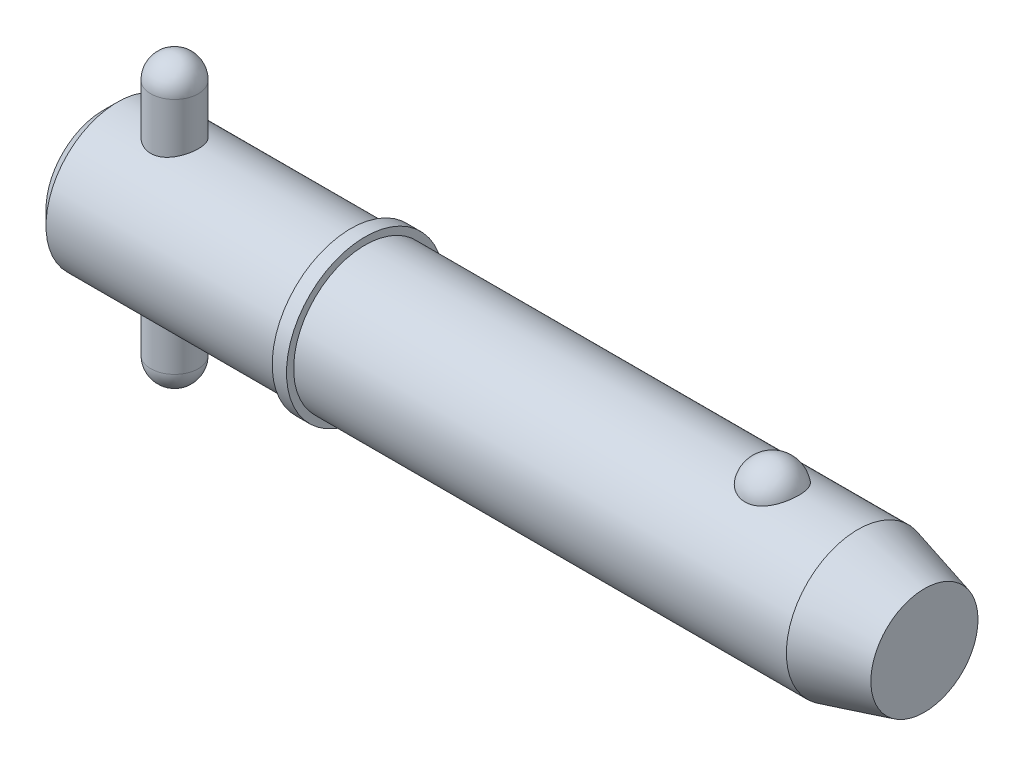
ISO-10303-21;
HEADER;
FILE_DESCRIPTION(('STEP AP214'),'2;1');
FILE_NAME('part.step','',(''),(''),'','','');
FILE_SCHEMA(('AUTOMOTIVE_DESIGN { 1 0 10303 214 1 1 1 1 }'));
ENDSEC;
DATA;
#1=APPLICATION_CONTEXT('core data for automotive mechanical design processes');
#2=APPLICATION_PROTOCOL_DEFINITION('international standard','automotive_design',2000,#1);
#3=PRODUCT_CONTEXT('',#1,'mechanical');
#4=PRODUCT('Part','Part','',(#3));
#5=PRODUCT_RELATED_PRODUCT_CATEGORY('part','',(#4));
#6=PRODUCT_DEFINITION_FORMATION('','',#4);
#7=PRODUCT_DEFINITION_CONTEXT('part definition',#1,'design');
#8=PRODUCT_DEFINITION('design','',#6,#7);
#9=PRODUCT_DEFINITION_SHAPE('','',#8);
#10=(LENGTH_UNIT() NAMED_UNIT(*) SI_UNIT(.MILLI.,.METRE.));
#11=(NAMED_UNIT(*) PLANE_ANGLE_UNIT() SI_UNIT($,.RADIAN.));
#12=(NAMED_UNIT(*) SI_UNIT($,.STERADIAN.) SOLID_ANGLE_UNIT());
#13=UNCERTAINTY_MEASURE_WITH_UNIT(LENGTH_MEASURE(1.E-05),#10,'distance_accuracy_value','');
#14=(GEOMETRIC_REPRESENTATION_CONTEXT(3) GLOBAL_UNCERTAINTY_ASSIGNED_CONTEXT((#13)) GLOBAL_UNIT_ASSIGNED_CONTEXT((#10,
#11,#12)) REPRESENTATION_CONTEXT('',''));
#15=CARTESIAN_POINT('',(0.,0.,0.));
#16=DIRECTION('',(0.,0.,1.));
#17=DIRECTION('',(1.,0.,0.));
#18=AXIS2_PLACEMENT_3D('',#15,#16,#17);
#19=CARTESIAN_POINT('',(9.525,19.05,0.));
#20=DIRECTION('',(0.,-1.,0.));
#21=DIRECTION('',(0.,0.,-1.));
#22=AXIS2_PLACEMENT_3D('',#19,#20,#21);
#23=CYLINDRICAL_SURFACE('',#22,3.175);
#24=CARTESIAN_POINT('',(9.525,-15.875,0.));
#25=DIRECTION('',(0.,-1.,0.));
#26=DIRECTION('',(0.,0.,-1.));
#27=AXIS2_PLACEMENT_3D('',#24,#25,#26);
#28=CIRCLE('',#27,3.175);
#29=CARTESIAN_POINT('',(9.525,-15.875,-3.175));
#30=VERTEX_POINT('',#29);
#31=EDGE_CURVE('P0_E10',#30,#30,#28,.F.);
#32=CARTESIAN_POINT('',(9.525,15.875,0.));
#33=DIRECTION('',(0.,-1.,0.));
#34=DIRECTION('',(0.,0.,-1.));
#35=AXIS2_PLACEMENT_3D('',#32,#33,#34);
#36=CIRCLE('',#35,3.175);
#37=CARTESIAN_POINT('',(9.525,15.875,-3.175));
#38=VERTEX_POINT('',#37);
#39=EDGE_CURVE('P0_E21',#38,#38,#36,.T.);
#40=CARTESIAN_POINT('',(9.525,-15.875,-3.175));
#41=CARTESIAN_POINT('',(9.525,-15.5442708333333,-3.175));
#42=CARTESIAN_POINT('',(9.525,-15.2135416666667,-3.175));
#43=CARTESIAN_POINT('',(9.525,-14.5520833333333,-3.175));
#44=CARTESIAN_POINT('',(9.525,-14.2213541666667,-3.175));
#45=CARTESIAN_POINT('',(9.525,-13.5598958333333,-3.175));
#46=CARTESIAN_POINT('',(9.525,-13.2291666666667,-3.175));
#47=CARTESIAN_POINT('',(9.525,-12.5677083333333,-3.175));
#48=CARTESIAN_POINT('',(9.525,-12.2369791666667,-3.175));
#49=CARTESIAN_POINT('',(9.525,-11.5755208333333,-3.175));
#50=CARTESIAN_POINT('',(9.525,-11.2447916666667,-3.175));
#51=CARTESIAN_POINT('',(9.525,-10.5833333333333,-3.175));
#52=CARTESIAN_POINT('',(9.525,-10.2526041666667,-3.175));
#53=CARTESIAN_POINT('',(9.525,-9.59114583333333,-3.175));
#54=CARTESIAN_POINT('',(9.525,-9.26041666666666,-3.175));
#55=CARTESIAN_POINT('',(9.525,-8.59895833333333,-3.175));
#56=CARTESIAN_POINT('',(9.525,-8.26822916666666,-3.175));
#57=CARTESIAN_POINT('',(9.525,-7.60677083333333,-3.175));
#58=CARTESIAN_POINT('',(9.525,-7.27604166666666,-3.175));
#59=CARTESIAN_POINT('',(9.525,-6.61458333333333,-3.175));
#60=CARTESIAN_POINT('',(9.525,-6.28385416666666,-3.175));
#61=CARTESIAN_POINT('',(9.525,-5.62239583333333,-3.175));
#62=CARTESIAN_POINT('',(9.525,-5.29166666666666,-3.175));
#63=CARTESIAN_POINT('',(9.525,-4.63020833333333,-3.175));
#64=CARTESIAN_POINT('',(9.525,-4.29947916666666,-3.175));
#65=CARTESIAN_POINT('',(9.525,-3.63802083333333,-3.175));
#66=CARTESIAN_POINT('',(9.525,-3.30729166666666,-3.175));
#67=CARTESIAN_POINT('',(9.525,-2.64583333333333,-3.175));
#68=CARTESIAN_POINT('',(9.525,-2.31510416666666,-3.175));
#69=CARTESIAN_POINT('',(9.525,-1.65364583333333,-3.175));
#70=CARTESIAN_POINT('',(9.525,-1.32291666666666,-3.175));
#71=CARTESIAN_POINT('',(9.525,-0.661458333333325,-3.175));
#72=CARTESIAN_POINT('',(9.525,-0.330729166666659,-3.175));
#73=CARTESIAN_POINT('',(9.525,0.330729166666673,-3.175));
#74=CARTESIAN_POINT('',(9.525,0.661458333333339,-3.175));
#75=CARTESIAN_POINT('',(9.525,1.32291666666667,-3.175));
#76=CARTESIAN_POINT('',(9.525,1.65364583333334,-3.175));
#77=CARTESIAN_POINT('',(9.525,2.31510416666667,-3.175));
#78=CARTESIAN_POINT('',(9.525,2.64583333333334,-3.175));
#79=CARTESIAN_POINT('',(9.525,3.30729166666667,-3.175));
#80=CARTESIAN_POINT('',(9.525,3.63802083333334,-3.175));
#81=CARTESIAN_POINT('',(9.525,4.29947916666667,-3.175));
#82=CARTESIAN_POINT('',(9.525,4.63020833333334,-3.175));
#83=CARTESIAN_POINT('',(9.525,5.29166666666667,-3.175));
#84=CARTESIAN_POINT('',(9.525,5.62239583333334,-3.175));
#85=CARTESIAN_POINT('',(9.525,6.28385416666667,-3.175));
#86=CARTESIAN_POINT('',(9.525,6.61458333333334,-3.175));
#87=CARTESIAN_POINT('',(9.525,7.27604166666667,-3.175));
#88=CARTESIAN_POINT('',(9.525,7.60677083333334,-3.175));
#89=CARTESIAN_POINT('',(9.525,8.26822916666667,-3.175));
#90=CARTESIAN_POINT('',(9.525,8.59895833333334,-3.175));
#91=CARTESIAN_POINT('',(9.525,9.26041666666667,-3.175));
#92=CARTESIAN_POINT('',(9.525,9.59114583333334,-3.175));
#93=CARTESIAN_POINT('',(9.525,10.2526041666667,-3.175));
#94=CARTESIAN_POINT('',(9.525,10.5833333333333,-3.175));
#95=CARTESIAN_POINT('',(9.525,11.2447916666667,-3.175));
#96=CARTESIAN_POINT('',(9.525,11.5755208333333,-3.175));
#97=CARTESIAN_POINT('',(9.525,12.2369791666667,-3.175));
#98=CARTESIAN_POINT('',(9.525,12.5677083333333,-3.175));
#99=CARTESIAN_POINT('',(9.525,13.2291666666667,-3.175));
#100=CARTESIAN_POINT('',(9.525,13.5598958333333,-3.175));
#101=CARTESIAN_POINT('',(9.525,14.2213541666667,-3.175));
#102=CARTESIAN_POINT('',(9.525,14.5520833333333,-3.175));
#103=CARTESIAN_POINT('',(9.525,15.2135416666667,-3.175));
#104=CARTESIAN_POINT('',(9.525,15.5442708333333,-3.175));
#105=CARTESIAN_POINT('',(9.525,15.875,-3.175));
#106=B_SPLINE_CURVE_WITH_KNOTS('',3,(#40,#41,#42,#43,#44,#45,#46,#47,#48,#49,#50,#51,#52,#53,
#54,#55,#56,#57,#58,#59,#60,#61,#62,#63,#64,#65,#66,#67,#68,#69,#70,#71,#72,#73,#74,#75,#76,#77,
#78,#79,#80,#81,#82,#83,#84,#85,#86,#87,#88,#89,#90,#91,#92,#93,#94,#95,#96,#97,#98,#99,#100,
#101,#102,#103,#104,#105),.UNSPECIFIED.,.F.,.F.,(4,2,2,2,2,2,2,2,2,2,2,2,2,2,2,2,2,2,2,2,2,2,2,
2,2,2,2,2,2,2,2,2,4),(0.,0.992187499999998,1.984375,2.9765625,3.96875,4.96093749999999,5.953125,
6.9453125,7.9375,8.92968749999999,9.921875,10.9140625,11.90625,12.8984375,13.890625,14.8828125,
15.875,16.8671875,17.859375,18.8515625,19.84375,20.8359375,21.828125,22.8203125,23.8125,
24.8046875,25.796875,26.7890625,27.78125,28.7734375,29.765625,30.7578125,31.75),.UNSPECIFIED.);
#107=EDGE_CURVE('P0_BSEAM14',#30,#38,#106,.T.);
#108=ORIENTED_EDGE('',*,*,#31,.T.);
#109=ORIENTED_EDGE('',*,*,#39,.T.);
#110=ORIENTED_EDGE('',*,*,#107,.T.);
#111=ORIENTED_EDGE('',*,*,#107,.F.);
#112=EDGE_LOOP('',(#108,#110,#109,#111));
#113=FACE_BOUND('',#112,.T.);
#114=ADVANCED_FACE('P0_F14',(#113),#23,.T.);
#115=CARTESIAN_POINT('',(9.525,-15.875,0.));
#116=DIRECTION('',(0.,0.,1.));
#117=DIRECTION('',(1.,0.,0.));
#118=AXIS2_PLACEMENT_3D('',#115,#116,#117);
#119=SPHERICAL_SURFACE('',#118,3.175);
#120=CARTESIAN_POINT('',(9.525,-15.875,0.));
#121=DIRECTION('',(0.,-1.,0.));
#122=DIRECTION('',(0.,0.,-1.));
#123=AXIS2_PLACEMENT_3D('',#120,#121,#122);
#124=SPHERICAL_SURFACE('',#123,3.175);
#125=ORIENTED_EDGE('',*,*,#31,.F.);
#126=EDGE_LOOP('',(#125));
#127=FACE_BOUND('',#126,.T.);
#128=ADVANCED_FACE('P0_F29',(#127),#124,.T.);
#129=CARTESIAN_POINT('',(9.525,15.875,0.));
#130=DIRECTION('',(0.,0.,1.));
#131=DIRECTION('',(1.,0.,0.));
#132=AXIS2_PLACEMENT_3D('',#129,#130,#131);
#133=SPHERICAL_SURFACE('',#132,3.175);
#134=CARTESIAN_POINT('',(9.525,15.875,0.));
#135=DIRECTION('',(0.,-1.,0.));
#136=DIRECTION('',(0.,0.,-1.));
#137=AXIS2_PLACEMENT_3D('',#134,#135,#136);
#138=SPHERICAL_SURFACE('',#137,3.175);
#139=ORIENTED_EDGE('',*,*,#39,.F.);
#140=EDGE_LOOP('',(#139));
#141=FACE_BOUND('',#140,.T.);
#142=ADVANCED_FACE('P0_F16',(#141),#138,.T.);
#143=CLOSED_SHELL('',(#114,#128,#142));
#144=MANIFOLD_SOLID_BREP('P0_B1',#143);
#145=CARTESIAN_POINT('',(0.,0.,0.));
#146=DIRECTION('',(1.,0.,0.));
#147=DIRECTION('',(0.,0.,-1.));
#148=AXIS2_PLACEMENT_3D('',#145,#146,#147);
#149=CYLINDRICAL_SURFACE('',#148,9.525);
#150=CARTESIAN_POINT('',(100.643054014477,0.,0.));
#151=DIRECTION('',(1.,0.,0.));
#152=DIRECTION('',(0.,0.,-1.));
#153=AXIS2_PLACEMENT_3D('',#150,#151,#152);
#154=CIRCLE('',#153,9.525);
#155=CARTESIAN_POINT('',(100.643054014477,0.,-9.525));
#156=VERTEX_POINT('',#155);
#157=EDGE_CURVE('P1_E81',#156,#156,#154,.T.);
#158=ORIENTED_EDGE('',*,*,#157,.F.);
#159=EDGE_LOOP('',(#158));
#160=FACE_BOUND('',#159,.T.);
#161=CARTESIAN_POINT('',(34.93,0.,0.));
#162=DIRECTION('',(1.,0.,0.));
#163=DIRECTION('',(0.,0.,-1.));
#164=AXIS2_PLACEMENT_3D('',#161,#162,#163);
#165=CIRCLE('',#164,9.525);
#166=CARTESIAN_POINT('',(34.93,0.,-9.525));
#167=VERTEX_POINT('',#166);
#168=EDGE_CURVE('P1_E85',#167,#167,#165,.T.);
#169=ORIENTED_EDGE('',*,*,#168,.T.);
#170=EDGE_LOOP('',(#169));
#171=FACE_BOUND('',#170,.T.);
#172=CARTESIAN_POINT('',(89.2457573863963,8.80405803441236,3.63513233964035));
#173=CARTESIAN_POINT('',(89.1516766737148,8.80405953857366,3.63513053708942));
#174=CARTESIAN_POINT('',(89.0575618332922,8.80561325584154,3.6313746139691));
#175=CARTESIAN_POINT('',(88.8700126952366,8.81177748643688,3.61638665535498));
#176=CARTESIAN_POINT('',(88.7765788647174,8.81638992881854,3.60514990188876));
#177=CARTESIAN_POINT('',(88.4979452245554,8.8346711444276,3.56024627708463));
#178=CARTESIAN_POINT('',(88.3146916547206,8.85278327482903,3.51538626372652));
#179=CARTESIAN_POINT('',(87.9595099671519,8.89871214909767,3.39742145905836));
#180=CARTESIAN_POINT('',(87.7875533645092,8.9265032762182,3.32439116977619));
#181=CARTESIAN_POINT('',(87.458707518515,8.98874819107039,3.15220244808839));
#182=CARTESIAN_POINT('',(87.3018114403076,9.02319893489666,3.05305594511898));
#183=CARTESIAN_POINT('',(87.0022147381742,9.09629186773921,2.82797815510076));
#184=CARTESIAN_POINT('',(86.8600600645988,9.13502685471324,2.7013513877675));
#185=CARTESIAN_POINT('',(86.5982999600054,9.2118657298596,2.4264193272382));
#186=CARTESIAN_POINT('',(86.4787015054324,9.2499694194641,2.27810735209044));
#187=CARTESIAN_POINT('',(86.259645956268,9.3234108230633,1.95652290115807));
#188=CARTESIAN_POINT('',(86.1613174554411,9.35855090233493,1.78243511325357));
#189=CARTESIAN_POINT('',(85.9938190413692,9.42045142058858,1.41937246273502));
#190=CARTESIAN_POINT('',(85.9246511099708,9.44721128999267,1.23039658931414));
#191=CARTESIAN_POINT('',(85.8161994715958,9.48990641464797,0.840370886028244));
#192=CARTESIAN_POINT('',(85.7772880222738,9.50570658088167,0.639202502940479));
#193=CARTESIAN_POINT('',(85.7315550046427,9.52433146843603,0.232664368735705));
#194=CARTESIAN_POINT('',(85.7247324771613,9.52715657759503,0.0272947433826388));
#195=CARTESIAN_POINT('',(85.743255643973,9.51956918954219,-0.380478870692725));
#196=CARTESIAN_POINT('',(85.7684052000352,9.50923740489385,-0.58289331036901));
#197=CARTESIAN_POINT('',(85.8500253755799,9.47651897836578,-0.980293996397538));
#198=CARTESIAN_POINT('',(85.9064966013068,9.45413210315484,-1.17528009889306));
#199=CARTESIAN_POINT('',(86.0497192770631,9.39954044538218,-1.55263697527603));
#200=CARTESIAN_POINT('',(86.1365124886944,9.36732213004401,-1.73498993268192));
#201=CARTESIAN_POINT('',(86.3386103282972,9.29640700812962,-2.08177763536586));
#202=CARTESIAN_POINT('',(86.4539172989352,9.25770966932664,-2.24621090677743));
#203=CARTESIAN_POINT('',(86.711264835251,9.17775604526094,-2.5533833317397));
#204=CARTESIAN_POINT('',(86.8534344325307,9.136488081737,-2.696011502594));
#205=CARTESIAN_POINT('',(87.16089985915,9.05620497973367,-2.95451229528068));
#206=CARTESIAN_POINT('',(87.3261937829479,9.01718965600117,-3.07038711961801));
#207=CARTESIAN_POINT('',(87.672052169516,8.9468001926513,-3.26976836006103));
#208=CARTESIAN_POINT('',(87.8522278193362,8.91528408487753,-3.35389750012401));
#209=CARTESIAN_POINT('',(88.2256514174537,8.86272514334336,-3.49043503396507));
#210=CARTESIAN_POINT('',(88.4188944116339,8.8416783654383,-3.54285537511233));
#211=CARTESIAN_POINT('',(88.8025036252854,8.81348056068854,-3.61241306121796));
#212=CARTESIAN_POINT('',(88.9925251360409,8.80568348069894,-3.63119339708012));
#213=CARTESIAN_POINT('',(89.3731906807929,8.80289410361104,-3.63795342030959));
#214=CARTESIAN_POINT('',(89.5638345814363,8.80789922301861,-3.62593932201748));
#215=CARTESIAN_POINT('',(89.9340076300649,8.8297491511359,-3.57238430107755));
#216=CARTESIAN_POINT('',(90.1136976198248,8.84621463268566,-3.53178890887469));
#217=CARTESIAN_POINT('',(90.463422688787,8.88875330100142,-3.42331083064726));
#218=CARTESIAN_POINT('',(90.6334569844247,8.91482726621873,-3.35542593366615));
#219=CARTESIAN_POINT('',(90.9632377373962,8.97448239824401,-3.19248225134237));
#220=CARTESIAN_POINT('',(91.1226801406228,9.00821446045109,-3.09686474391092));
#221=CARTESIAN_POINT('',(91.4235136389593,9.07935398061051,-2.88162736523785));
#222=CARTESIAN_POINT('',(91.5649005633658,9.11676228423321,-2.76200196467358));
#223=CARTESIAN_POINT('',(91.8333193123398,9.19347419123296,-2.49516285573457));
#224=CARTESIAN_POINT('',(91.9592750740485,9.23277872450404,-2.34686614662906));
#225=CARTESIAN_POINT('',(92.1855227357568,9.30737610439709,-2.03093683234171));
#226=CARTESIAN_POINT('',(92.2858100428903,9.34266823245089,-1.86330077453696));
#227=CARTESIAN_POINT('',(92.4615149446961,9.40674710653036,-1.50744893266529));
#228=CARTESIAN_POINT('',(92.536041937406,9.4352917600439,-1.31874876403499));
#229=CARTESIAN_POINT('',(92.6541650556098,9.48144132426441,-0.930631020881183));
#230=CARTESIAN_POINT('',(92.6977608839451,9.49904612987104,-0.731213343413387));
#231=CARTESIAN_POINT('',(92.7531580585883,9.5215314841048,-0.327147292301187));
#232=CARTESIAN_POINT('',(92.7649354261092,9.52640243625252,-0.122495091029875));
#233=CARTESIAN_POINT('',(92.7563825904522,9.52289571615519,0.286018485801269));
#234=CARTESIAN_POINT('',(92.7360530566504,9.51451832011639,0.489879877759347));
#235=CARTESIAN_POINT('',(92.6638840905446,9.48544083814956,0.88999431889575));
#236=CARTESIAN_POINT('',(92.6121993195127,9.46480124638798,1.08627971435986));
#237=CARTESIAN_POINT('',(92.4784917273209,9.4133389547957,1.46682086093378));
#238=CARTESIAN_POINT('',(92.3964668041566,9.38251554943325,1.65107577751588));
#239=CARTESIAN_POINT('',(92.2031929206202,9.31365636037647,2.00346348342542));
#240=CARTESIAN_POINT('',(92.0917838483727,9.27558138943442,2.17150083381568));
#241=CARTESIAN_POINT('',(91.8422947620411,9.19638714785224,2.48563115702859));
#242=CARTESIAN_POINT('',(91.7042163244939,9.15526805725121,2.63172542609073));
#243=CARTESIAN_POINT('',(91.4048438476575,9.07465393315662,2.89750997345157));
#244=CARTESIAN_POINT('',(91.2436109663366,9.03515496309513,3.01726776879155));
#245=CARTESIAN_POINT('',(90.9016136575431,8.96227564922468,3.22732920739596));
#246=CARTESIAN_POINT('',(90.720841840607,8.92889763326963,3.31762165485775));
#247=CARTESIAN_POINT('',(90.3514451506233,8.8734538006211,3.46314419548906));
#248=CARTESIAN_POINT('',(90.1633237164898,8.85102983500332,3.51950082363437));
#249=CARTESIAN_POINT('',(89.8757869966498,8.8266696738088,3.57993683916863));
#250=CARTESIAN_POINT('',(89.7791339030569,8.82009725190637,3.59606217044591));
#251=CARTESIAN_POINT('',(89.5846770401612,8.81020897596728,3.62022512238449));
#252=CARTESIAN_POINT('',(89.4868741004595,8.80689090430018,3.62826825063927));
#253=CARTESIAN_POINT('',(89.3412243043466,8.80445615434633,3.63416760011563));
#254=CARTESIAN_POINT('',(89.2934952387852,8.80405727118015,3.63513325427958));
#255=CARTESIAN_POINT('',(89.2457573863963,8.80405803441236,3.63513233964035));
#256=B_SPLINE_CURVE_WITH_KNOTS('',3,(#172,#173,#174,#175,#176,#177,#178,#179,#180,#181,#182,
#183,#184,#185,#186,#187,#188,#189,#190,#191,#192,#193,#194,#195,#196,#197,#198,#199,#200,#201,
#202,#203,#204,#205,#206,#207,#208,#209,#210,#211,#212,#213,#214,#215,#216,#217,#218,#219,#220,
#221,#222,#223,#224,#225,#226,#227,#228,#229,#230,#231,#232,#233,#234,#235,#236,#237,#238,#239,
#240,#241,#242,#243,#244,#245,#246,#247,#248,#249,#250,#251,#252,#253,#254,#255),.UNSPECIFIED.,
.T.,.F.,(4,2,2,2,2,2,2,2,2,2,2,2,2,2,2,2,2,2,2,2,2,2,2,2,2,2,2,2,2,2,2,2,2,2,2,2,2,2,2,2,2,4),
(0.,0.282202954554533,0.564584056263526,1.13017050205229,1.69427128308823,2.258114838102,
2.83836627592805,3.41879688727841,4.02497117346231,4.63118665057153,5.24474754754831,
5.85829010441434,6.46808687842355,7.07789545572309,7.68854723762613,8.29924920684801,
8.91296283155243,9.52662591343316,10.1275338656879,10.7282152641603,11.2986646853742,
11.868998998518,12.4213015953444,12.973648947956,13.5380053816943,14.1024919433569,
14.695298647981,15.2882113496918,15.8999469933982,16.5116885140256,17.1238909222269,
17.7360805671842,18.3452748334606,18.9545113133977,19.567138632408,20.1797297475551,
20.7907316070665,21.4019653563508,21.9915938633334,22.2859053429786,22.5800161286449,
22.723209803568),.UNSPECIFIED.);
#257=CARTESIAN_POINT('',(89.2457573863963,8.80405803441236,3.63513233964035));
#258=VERTEX_POINT('',#257);
#259=EDGE_CURVE('P1_E35',#258,#258,#256,.T.);
#260=ORIENTED_EDGE('',*,*,#259,.T.);
#261=EDGE_LOOP('',(#260));
#262=FACE_BOUND('',#261,.T.);
#263=ADVANCED_FACE('P1_F13',(#160,#171,#262),#149,.T.);
#264=CARTESIAN_POINT('',(0.,0.,0.));
#265=DIRECTION('',(-1.,0.,0.));
#266=DIRECTION('',(0.,0.,1.));
#267=AXIS2_PLACEMENT_3D('',#264,#265,#266);
#268=PLANE('',#267);
#269=CARTESIAN_POINT('',(0.,0.,0.));
#270=DIRECTION('',(1.,0.,0.));
#271=DIRECTION('',(0.,0.,-1.));
#272=AXIS2_PLACEMENT_3D('',#269,#270,#271);
#273=CIRCLE('',#272,7.62);
#274=CARTESIAN_POINT('',(0.,0.,-7.62));
#275=VERTEX_POINT('',#274);
#276=EDGE_CURVE('P1_E9',#275,#275,#273,.T.);
#277=ORIENTED_EDGE('',*,*,#276,.F.);
#278=EDGE_LOOP('',(#277));
#279=FACE_BOUND('',#278,.T.);
#280=ADVANCED_FACE('P1_F15',(#279),#268,.T.);
#281=CARTESIAN_POINT('',(1.90499999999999,0.,0.));
#282=DIRECTION('',(1.,0.,0.));
#283=DIRECTION('',(0.,0.,-1.));
#284=AXIS2_PLACEMENT_3D('',#281,#282,#283);
#285=CONICAL_SURFACE('',#284,9.525,0.785398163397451);
#286=ORIENTED_EDGE('',*,*,#276,.T.);
#287=EDGE_LOOP('',(#286));
#288=FACE_BOUND('',#287,.T.);
#289=CARTESIAN_POINT('',(1.90499999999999,0.,0.));
#290=DIRECTION('',(1.,0.,0.));
#291=DIRECTION('',(0.,0.,-1.));
#292=AXIS2_PLACEMENT_3D('',#289,#290,#291);
#293=CIRCLE('',#292,9.525);
#294=CARTESIAN_POINT('',(1.90499999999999,0.,-9.525));
#295=VERTEX_POINT('',#294);
#296=EDGE_CURVE('P1_E26',#295,#295,#293,.T.);
#297=ORIENTED_EDGE('',*,*,#296,.F.);
#298=EDGE_LOOP('',(#297));
#299=FACE_BOUND('',#298,.T.);
#300=ADVANCED_FACE('P1_F77',(#288,#299),#285,.T.);
#301=CARTESIAN_POINT('',(0.,0.,0.));
#302=DIRECTION('',(1.,0.,0.));
#303=DIRECTION('',(0.,0.,-1.));
#304=AXIS2_PLACEMENT_3D('',#301,#302,#303);
#305=CYLINDRICAL_SURFACE('',#304,9.525);
#306=CARTESIAN_POINT('',(9.525,-8.98025612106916,3.175));
#307=CARTESIAN_POINT('',(9.35206354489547,-8.98025555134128,3.17500081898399));
#308=CARTESIAN_POINT('',(9.17913201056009,-8.98530617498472,3.16082293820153));
#309=CARTESIAN_POINT('',(8.83839221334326,-9.00485797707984,3.10467734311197));
#310=CARTESIAN_POINT('',(8.67058479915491,-9.0193607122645,3.06270505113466));
#311=CARTESIAN_POINT('',(8.34508461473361,-9.05599546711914,2.95260866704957));
#312=CARTESIAN_POINT('',(8.18737272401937,-9.07811252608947,2.88453582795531));
#313=CARTESIAN_POINT('',(7.88555684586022,-9.12746212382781,2.72434567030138));
#314=CARTESIAN_POINT('',(7.74145587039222,-9.1546957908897,2.63222304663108));
#315=CARTESIAN_POINT('',(7.46531411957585,-9.21240503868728,2.42268738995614));
#316=CARTESIAN_POINT('',(7.33388351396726,-9.24296141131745,2.30449228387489));
#317=CARTESIAN_POINT('',(7.09229340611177,-9.30319020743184,2.0478358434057));
#318=CARTESIAN_POINT('',(6.98213731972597,-9.33286248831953,1.90937126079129));
#319=CARTESIAN_POINT('',(6.78345450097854,-9.38891527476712,1.61164431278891));
#320=CARTESIAN_POINT('',(6.69556709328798,-9.41518969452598,1.45193356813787));
#321=CARTESIAN_POINT('',(6.54814671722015,-9.46053437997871,1.11896913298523));
#322=CARTESIAN_POINT('',(6.48860610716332,-9.47960658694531,0.945719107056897));
#323=CARTESIAN_POINT('',(6.40163866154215,-9.50782564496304,0.596991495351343));
#324=CARTESIAN_POINT('',(6.373166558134,-9.5172947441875,0.421801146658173));
#325=CARTESIAN_POINT('',(6.3458207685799,-9.52638456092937,0.068890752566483));
#326=CARTESIAN_POINT('',(6.34693945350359,-9.52600781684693,-0.108828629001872));
#327=CARTESIAN_POINT('',(6.37808050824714,-9.51566675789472,-0.454353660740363));
#328=CARTESIAN_POINT('',(6.4069675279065,-9.50607905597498,-0.622274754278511));
#329=CARTESIAN_POINT('',(6.490947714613,-9.47886621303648,-0.950732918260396));
#330=CARTESIAN_POINT('',(6.54604265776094,-9.46124052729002,-1.11126948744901));
#331=CARTESIAN_POINT('',(6.68153768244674,-9.41945253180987,-1.42288410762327));
#332=CARTESIAN_POINT('',(6.76226085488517,-9.3952073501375,-1.57381010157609));
#333=CARTESIAN_POINT('',(6.94645456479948,-9.34270397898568,-1.86030973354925));
#334=CARTESIAN_POINT('',(7.04993142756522,-9.31444467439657,-1.99587908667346));
#335=CARTESIAN_POINT('',(7.28241619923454,-9.25532159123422,-2.2545702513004));
#336=CARTESIAN_POINT('',(7.4123967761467,-9.22439783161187,-2.37680549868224));
#337=CARTESIAN_POINT('',(7.69127470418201,-9.1645528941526,-2.5980302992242));
#338=CARTESIAN_POINT('',(7.84017496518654,-9.13563202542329,-2.6970162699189));
#339=CARTESIAN_POINT('',(8.15547526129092,-9.08273917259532,-2.87016016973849));
#340=CARTESIAN_POINT('',(8.32209451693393,-9.05884361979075,-2.94394402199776));
#341=CARTESIAN_POINT('',(8.66638917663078,-9.01959241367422,-3.06210713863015));
#342=CARTESIAN_POINT('',(8.84405991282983,-9.00423318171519,-3.10649872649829));
#343=CARTESIAN_POINT('',(9.19682677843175,-8.98460345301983,-3.16281207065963));
#344=CARTESIAN_POINT('',(9.37167742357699,-8.9798639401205,-3.17610837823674));
#345=CARTESIAN_POINT('',(9.72113927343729,-8.9806993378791,-3.17374726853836));
#346=CARTESIAN_POINT('',(9.89575051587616,-8.98627237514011,-3.15809511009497));
#347=CARTESIAN_POINT('',(10.2335233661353,-9.00663737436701,-3.09951644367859));
#348=CARTESIAN_POINT('',(10.3968722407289,-9.02110608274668,-3.05754530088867));
#349=CARTESIAN_POINT('',(10.7141759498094,-9.05727657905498,-2.94866651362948));
#350=CARTESIAN_POINT('',(10.8681291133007,-9.07897964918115,-2.88175444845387));
#351=CARTESIAN_POINT('',(11.1676828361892,-9.12802586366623,-2.72248103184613));
#352=CARTESIAN_POINT('',(11.3128635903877,-9.1555260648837,-2.62937980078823));
#353=CARTESIAN_POINT('',(11.5860387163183,-9.21276315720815,-2.42120937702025));
#354=CARTESIAN_POINT('',(11.7140280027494,-9.24250070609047,-2.30613370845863));
#355=CARTESIAN_POINT('',(11.9555513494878,-9.30259247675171,-2.05070616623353));
#356=CARTESIAN_POINT('',(12.0680936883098,-9.33290753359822,-1.90940458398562));
#357=CARTESIAN_POINT('',(12.267933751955,-9.3893275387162,-1.60917665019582));
#358=CARTESIAN_POINT('',(12.3552323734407,-9.41543263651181,-1.45025092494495));
#359=CARTESIAN_POINT('',(12.5013088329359,-9.46036988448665,-1.12007606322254));
#360=CARTESIAN_POINT('',(12.5602723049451,-9.47924920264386,-0.9489158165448));
#361=CARTESIAN_POINT('',(12.6483355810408,-9.50781089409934,-0.598355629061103));
#362=CARTESIAN_POINT('',(12.6774461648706,-9.5174965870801,-0.4189586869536));
#363=CARTESIAN_POINT('',(12.7040070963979,-9.52632915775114,-0.066088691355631));
#364=CARTESIAN_POINT('',(12.7028811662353,-9.52594996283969,0.107266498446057));
#365=CARTESIAN_POINT('',(12.6725130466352,-9.51586223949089,0.451202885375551));
#366=CARTESIAN_POINT('',(12.643273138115,-9.50615446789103,0.621784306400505));
#367=CARTESIAN_POINT('',(12.5584514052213,-9.47867404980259,0.952633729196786));
#368=CARTESIAN_POINT('',(12.5032953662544,-9.46103195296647,1.1130225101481));
#369=CARTESIAN_POINT('',(12.3686013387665,-9.41949985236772,1.42233126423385));
#370=CARTESIAN_POINT('',(12.2890589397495,-9.39560871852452,1.57124915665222));
#371=CARTESIAN_POINT('',(12.1044667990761,-9.34294133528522,1.85938800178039));
#372=CARTESIAN_POINT('',(11.9985831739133,-9.31401720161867,1.9980473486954));
#373=CARTESIAN_POINT('',(11.7657327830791,-9.25490239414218,2.25609475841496));
#374=CARTESIAN_POINT('',(11.6387592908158,-9.22471131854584,2.37547664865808));
#375=CARTESIAN_POINT('',(11.3613902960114,-9.16505913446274,2.59633024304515));
#376=CARTESIAN_POINT('',(11.2102725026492,-9.13567286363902,2.69691791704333));
#377=CARTESIAN_POINT('',(10.8923631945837,-9.08241113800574,2.87119803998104));
#378=CARTESIAN_POINT('',(10.7255757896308,-9.05853424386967,2.94489751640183));
#379=CARTESIAN_POINT('',(10.3887212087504,-9.02021736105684,3.06020415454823));
#380=CARTESIAN_POINT('',(10.219143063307,-9.00539959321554,3.10311136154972));
#381=CARTESIAN_POINT('',(9.87470703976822,-8.98542092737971,3.16050396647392));
#382=CARTESIAN_POINT('',(9.699851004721,-8.98025669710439,3.17499917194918));
#383=CARTESIAN_POINT('',(9.525,-8.98025612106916,3.175));
#384=B_SPLINE_CURVE_WITH_KNOTS('',3,(#306,#307,#308,#309,#310,#311,#312,#313,#314,#315,#316,
#317,#318,#319,#320,#321,#322,#323,#324,#325,#326,#327,#328,#329,#330,#331,#332,#333,#334,#335,
#336,#337,#338,#339,#340,#341,#342,#343,#344,#345,#346,#347,#348,#349,#350,#351,#352,#353,#354,
#355,#356,#357,#358,#359,#360,#361,#362,#363,#364,#365,#366,#367,#368,#369,#370,#371,#372,#373,
#374,#375,#376,#377,#378,#379,#380,#381,#382,#383),.UNSPECIFIED.,.T.,.F.,(4,2,2,2,2,2,2,2,2,2,2,
2,2,2,2,2,2,2,2,2,2,2,2,2,2,2,2,2,2,2,2,2,2,2,2,2,2,2,4),(0.,0.518161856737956,1.03640907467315,
1.55364379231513,2.07099270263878,2.60671746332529,3.14252816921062,3.69231882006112,
4.24196117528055,4.77247962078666,5.30286129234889,5.81244090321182,6.32205505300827,
6.83836754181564,7.3548237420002,7.89559553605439,8.43645060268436,8.98501631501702,
9.53335188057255,10.056948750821,10.5804505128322,11.0859695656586,11.5915782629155,
12.1132237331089,12.6350231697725,13.1819271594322,13.7288117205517,14.2720628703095,
14.815117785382,15.3326491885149,15.8501386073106,16.3594083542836,16.868770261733,
17.3969527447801,17.925304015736,18.4743376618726,19.023227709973,19.5473069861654,
20.0712053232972),.UNSPECIFIED.);
#385=CARTESIAN_POINT('',(9.525,-8.98025612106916,3.175));
#386=VERTEX_POINT('',#385);
#387=EDGE_CURVE('P1_E17',#386,#386,#384,.T.);
#388=ORIENTED_EDGE('',*,*,#387,.F.);
#389=EDGE_LOOP('',(#388));
#390=FACE_BOUND('',#389,.T.);
#391=CARTESIAN_POINT('',(9.525,8.98025612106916,3.175));
#392=CARTESIAN_POINT('',(9.69793645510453,8.98025555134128,3.17500081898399));
#393=CARTESIAN_POINT('',(9.87086798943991,8.98530617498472,3.16082293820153));
#394=CARTESIAN_POINT('',(10.2116077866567,9.00485797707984,3.10467734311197));
#395=CARTESIAN_POINT('',(10.3794152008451,9.0193607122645,3.06270505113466));
#396=CARTESIAN_POINT('',(10.7049153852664,9.05599546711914,2.95260866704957));
#397=CARTESIAN_POINT('',(10.8626272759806,9.07811252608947,2.88453582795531));
#398=CARTESIAN_POINT('',(11.1644431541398,9.12746212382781,2.72434567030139));
#399=CARTESIAN_POINT('',(11.3085441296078,9.15469579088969,2.63222304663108));
#400=CARTESIAN_POINT('',(11.5846858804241,9.21240503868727,2.42268738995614));
#401=CARTESIAN_POINT('',(11.7161164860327,9.24296141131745,2.30449228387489));
#402=CARTESIAN_POINT('',(11.9577065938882,9.30319020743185,2.0478358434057));
#403=CARTESIAN_POINT('',(12.067862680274,9.33286248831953,1.90937126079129));
#404=CARTESIAN_POINT('',(12.2665454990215,9.38891527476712,1.61164431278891));
#405=CARTESIAN_POINT('',(12.354432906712,9.41518969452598,1.45193356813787));
#406=CARTESIAN_POINT('',(12.5018532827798,9.46053437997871,1.11896913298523));
#407=CARTESIAN_POINT('',(12.5613938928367,9.47960658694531,0.945719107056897));
#408=CARTESIAN_POINT('',(12.6483613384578,9.50782564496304,0.596991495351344));
#409=CARTESIAN_POINT('',(12.676833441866,9.5172947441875,0.421801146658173));
#410=CARTESIAN_POINT('',(12.7041792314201,9.52638456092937,0.0688907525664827));
#411=CARTESIAN_POINT('',(12.7030605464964,9.52600781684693,-0.108828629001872));
#412=CARTESIAN_POINT('',(12.6719194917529,9.51566675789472,-0.454353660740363));
#413=CARTESIAN_POINT('',(12.6430324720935,9.50607905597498,-0.622274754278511));
#414=CARTESIAN_POINT('',(12.559052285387,9.47886621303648,-0.950732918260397));
#415=CARTESIAN_POINT('',(12.5039573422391,9.46124052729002,-1.11126948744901));
#416=CARTESIAN_POINT('',(12.3684623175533,9.41945253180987,-1.42288410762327));
#417=CARTESIAN_POINT('',(12.2877391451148,9.3952073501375,-1.57381010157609));
#418=CARTESIAN_POINT('',(12.1035454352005,9.34270397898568,-1.86030973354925));
#419=CARTESIAN_POINT('',(12.0000685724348,9.31444467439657,-1.99587908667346));
#420=CARTESIAN_POINT('',(11.7675838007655,9.25532159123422,-2.2545702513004));
#421=CARTESIAN_POINT('',(11.6376032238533,9.22439783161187,-2.37680549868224));
#422=CARTESIAN_POINT('',(11.358725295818,9.1645528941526,-2.5980302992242));
#423=CARTESIAN_POINT('',(11.2098250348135,9.13563202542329,-2.6970162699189));
#424=CARTESIAN_POINT('',(10.8945247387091,9.08273917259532,-2.87016016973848));
#425=CARTESIAN_POINT('',(10.7279054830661,9.05884361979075,-2.94394402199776));
#426=CARTESIAN_POINT('',(10.3836108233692,9.01959241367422,-3.06210713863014));
#427=CARTESIAN_POINT('',(10.2059400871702,9.00423318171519,-3.10649872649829));
#428=CARTESIAN_POINT('',(9.85317322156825,8.98460345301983,-3.16281207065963));
#429=CARTESIAN_POINT('',(9.67832257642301,8.9798639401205,-3.17610837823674));
#430=CARTESIAN_POINT('',(9.32886072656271,8.9806993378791,-3.17374726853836));
#431=CARTESIAN_POINT('',(9.15424948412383,8.98627237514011,-3.15809511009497));
#432=CARTESIAN_POINT('',(8.81647663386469,9.00663737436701,-3.09951644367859));
#433=CARTESIAN_POINT('',(8.65312775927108,9.02110608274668,-3.05754530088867));
#434=CARTESIAN_POINT('',(8.33582405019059,9.05727657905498,-2.94866651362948));
#435=CARTESIAN_POINT('',(8.18187088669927,9.07897964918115,-2.88175444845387));
#436=CARTESIAN_POINT('',(7.88231716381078,9.12802586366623,-2.72248103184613));
#437=CARTESIAN_POINT('',(7.73713640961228,9.1555260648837,-2.62937980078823));
#438=CARTESIAN_POINT('',(7.46396128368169,9.21276315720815,-2.42120937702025));
#439=CARTESIAN_POINT('',(7.33597199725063,9.24250070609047,-2.30613370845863));
#440=CARTESIAN_POINT('',(7.09444865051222,9.30259247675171,-2.05070616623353));
#441=CARTESIAN_POINT('',(6.98190631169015,9.33290753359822,-1.90940458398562));
#442=CARTESIAN_POINT('',(6.78206624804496,9.3893275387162,-1.60917665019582));
#443=CARTESIAN_POINT('',(6.6947676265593,9.41543263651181,-1.45025092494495));
#444=CARTESIAN_POINT('',(6.54869116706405,9.46036988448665,-1.12007606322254));
#445=CARTESIAN_POINT('',(6.48972769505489,9.47924920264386,-0.948915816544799));
#446=CARTESIAN_POINT('',(6.40166441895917,9.50781089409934,-0.598355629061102));
#447=CARTESIAN_POINT('',(6.3725538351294,9.5174965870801,-0.418958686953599));
#448=CARTESIAN_POINT('',(6.34599290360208,9.52632915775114,-0.0660886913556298));
#449=CARTESIAN_POINT('',(6.3471188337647,9.52594996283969,0.107266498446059));
#450=CARTESIAN_POINT('',(6.37748695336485,9.51586223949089,0.451202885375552));
#451=CARTESIAN_POINT('',(6.40672686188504,9.50615446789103,0.621784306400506));
#452=CARTESIAN_POINT('',(6.49154859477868,9.47867404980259,0.952633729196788));
#453=CARTESIAN_POINT('',(6.54670463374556,9.46103195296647,1.11302251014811));
#454=CARTESIAN_POINT('',(6.68139866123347,9.41949985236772,1.42233126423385));
#455=CARTESIAN_POINT('',(6.76094106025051,9.39560871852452,1.57124915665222));
#456=CARTESIAN_POINT('',(6.94553320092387,9.34294133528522,1.85938800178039));
#457=CARTESIAN_POINT('',(7.05141682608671,9.31401720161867,1.9980473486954));
#458=CARTESIAN_POINT('',(7.28426721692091,9.25490239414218,2.25609475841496));
#459=CARTESIAN_POINT('',(7.41124070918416,9.22471131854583,2.37547664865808));
#460=CARTESIAN_POINT('',(7.68860970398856,9.16505913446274,2.59633024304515));
#461=CARTESIAN_POINT('',(7.83972749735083,9.13567286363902,2.69691791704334));
#462=CARTESIAN_POINT('',(8.15763680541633,9.08241113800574,2.87119803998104));
#463=CARTESIAN_POINT('',(8.32442421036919,9.05853424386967,2.94489751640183));
#464=CARTESIAN_POINT('',(8.66127879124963,9.02021736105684,3.06020415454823));
#465=CARTESIAN_POINT('',(8.83085693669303,9.00539959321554,3.10311136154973));
#466=CARTESIAN_POINT('',(9.17529296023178,8.98542092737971,3.16050396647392));
#467=CARTESIAN_POINT('',(9.350148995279,8.98025669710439,3.17499917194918));
#468=CARTESIAN_POINT('',(9.525,8.98025612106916,3.175));
#469=B_SPLINE_CURVE_WITH_KNOTS('',3,(#391,#392,#393,#394,#395,#396,#397,#398,#399,#400,#401,
#402,#403,#404,#405,#406,#407,#408,#409,#410,#411,#412,#413,#414,#415,#416,#417,#418,#419,#420,
#421,#422,#423,#424,#425,#426,#427,#428,#429,#430,#431,#432,#433,#434,#435,#436,#437,#438,#439,
#440,#441,#442,#443,#444,#445,#446,#447,#448,#449,#450,#451,#452,#453,#454,#455,#456,#457,#458,
#459,#460,#461,#462,#463,#464,#465,#466,#467,#468),.UNSPECIFIED.,.T.,.F.,(4,2,2,2,2,2,2,2,2,2,2,
2,2,2,2,2,2,2,2,2,2,2,2,2,2,2,2,2,2,2,2,2,2,2,2,2,2,2,4),(0.,0.518161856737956,1.03640907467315,
1.55364379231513,2.07099270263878,2.60671746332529,3.14252816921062,3.69231882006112,
4.24196117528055,4.77247962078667,5.30286129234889,5.81244090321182,6.32205505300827,
6.83836754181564,7.3548237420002,7.89559553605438,8.43645060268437,8.98501631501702,
9.53335188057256,10.056948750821,10.5804505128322,11.0859695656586,11.5915782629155,
12.1132237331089,12.6350231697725,13.1819271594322,13.7288117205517,14.2720628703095,
14.815117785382,15.3326491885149,15.8501386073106,16.3594083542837,16.868770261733,
17.3969527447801,17.9253040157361,18.4743376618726,19.023227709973,19.5473069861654,
20.0712053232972),.UNSPECIFIED.);
#470=CARTESIAN_POINT('',(9.525,8.98025612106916,3.175));
#471=VERTEX_POINT('',#470);
#472=EDGE_CURVE('P1_E43',#471,#471,#469,.T.);
#473=ORIENTED_EDGE('',*,*,#472,.F.);
#474=EDGE_LOOP('',(#473));
#475=FACE_BOUND('',#474,.T.);
#476=ORIENTED_EDGE('',*,*,#296,.T.);
#477=EDGE_LOOP('',(#476));
#478=FACE_BOUND('',#477,.T.);
#479=CARTESIAN_POINT('',(33.025,0.,0.));
#480=DIRECTION('',(1.,0.,0.));
#481=DIRECTION('',(0.,0.,-1.));
#482=AXIS2_PLACEMENT_3D('',#479,#480,#481);
#483=CIRCLE('',#482,9.525);
#484=CARTESIAN_POINT('',(33.025,0.,-9.525));
#485=VERTEX_POINT('',#484);
#486=EDGE_CURVE('P1_E31',#485,#485,#483,.T.);
#487=ORIENTED_EDGE('',*,*,#486,.F.);
#488=EDGE_LOOP('',(#487));
#489=FACE_BOUND('',#488,.T.);
#490=ADVANCED_FACE('P1_F103',(#390,#475,#478,#489),#305,.T.);
#491=CARTESIAN_POINT('',(33.025,9.525,0.));
#492=DIRECTION('',(-1.,0.,0.));
#493=DIRECTION('',(0.,0.,1.));
#494=AXIS2_PLACEMENT_3D('',#491,#492,#493);
#495=PLANE('',#494);
#496=ORIENTED_EDGE('',*,*,#486,.T.);
#497=EDGE_LOOP('',(#496));
#498=FACE_BOUND('',#497,.T.);
#499=CARTESIAN_POINT('',(33.025,0.,0.));
#500=DIRECTION('',(1.,0.,0.));
#501=DIRECTION('',(0.,0.,-1.));
#502=AXIS2_PLACEMENT_3D('',#499,#500,#501);
#503=CIRCLE('',#502,10.4775);
#504=CARTESIAN_POINT('',(33.025,0.,-10.4775));
#505=VERTEX_POINT('',#504);
#506=EDGE_CURVE('P1_E91',#505,#505,#503,.T.);
#507=ORIENTED_EDGE('',*,*,#506,.F.);
#508=EDGE_LOOP('',(#507));
#509=FACE_BOUND('',#508,.T.);
#510=ADVANCED_FACE('P1_F100',(#498,#509),#495,.T.);
#511=CARTESIAN_POINT('',(0.,0.,0.));
#512=DIRECTION('',(1.,0.,0.));
#513=DIRECTION('',(0.,0.,-1.));
#514=AXIS2_PLACEMENT_3D('',#511,#512,#513);
#515=CYLINDRICAL_SURFACE('',#514,10.4775);
#516=ORIENTED_EDGE('',*,*,#506,.T.);
#517=EDGE_LOOP('',(#516));
#518=FACE_BOUND('',#517,.T.);
#519=CARTESIAN_POINT('',(34.93,0.,0.));
#520=DIRECTION('',(1.,0.,0.));
#521=DIRECTION('',(0.,0.,-1.));
#522=AXIS2_PLACEMENT_3D('',#519,#520,#521);
#523=CIRCLE('',#522,10.4775);
#524=CARTESIAN_POINT('',(34.93,0.,-10.4775));
#525=VERTEX_POINT('',#524);
#526=EDGE_CURVE('P1_E88',#525,#525,#523,.T.);
#527=ORIENTED_EDGE('',*,*,#526,.F.);
#528=EDGE_LOOP('',(#527));
#529=FACE_BOUND('',#528,.T.);
#530=ADVANCED_FACE('P1_F68',(#518,#529),#515,.T.);
#531=CARTESIAN_POINT('',(34.93,10.4775,0.));
#532=DIRECTION('',(1.,0.,0.));
#533=DIRECTION('',(0.,0.,-1.));
#534=AXIS2_PLACEMENT_3D('',#531,#532,#533);
#535=PLANE('',#534);
#536=ORIENTED_EDGE('',*,*,#526,.T.);
#537=EDGE_LOOP('',(#536));
#538=FACE_BOUND('',#537,.T.);
#539=ORIENTED_EDGE('',*,*,#168,.F.);
#540=EDGE_LOOP('',(#539));
#541=FACE_BOUND('',#540,.T.);
#542=ADVANCED_FACE('P1_F62',(#538,#541),#535,.T.);
#543=CARTESIAN_POINT('',(109.53,0.,0.));
#544=DIRECTION('',(-1.,0.,0.));
#545=DIRECTION('',(0.,0.,1.));
#546=AXIS2_PLACEMENT_3D('',#543,#544,#545);
#547=CONICAL_SURFACE('',#546,7.14375000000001,0.26179938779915);
#548=ORIENTED_EDGE('',*,*,#157,.T.);
#549=EDGE_LOOP('',(#548));
#550=FACE_BOUND('',#549,.T.);
#551=CARTESIAN_POINT('',(109.53,0.,0.));
#552=DIRECTION('',(1.,0.,0.));
#553=DIRECTION('',(0.,0.,-1.));
#554=AXIS2_PLACEMENT_3D('',#551,#552,#553);
#555=CIRCLE('',#554,7.14375000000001);
#556=CARTESIAN_POINT('',(109.53,0.,-7.14375000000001));
#557=VERTEX_POINT('',#556);
#558=EDGE_CURVE('P1_E42',#557,#557,#555,.T.);
#559=ORIENTED_EDGE('',*,*,#558,.F.);
#560=EDGE_LOOP('',(#559));
#561=FACE_BOUND('',#560,.T.);
#562=ADVANCED_FACE('P1_F59',(#550,#561),#547,.T.);
#563=CARTESIAN_POINT('',(109.53,7.14375000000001,0.));
#564=DIRECTION('',(1.,0.,0.));
#565=DIRECTION('',(0.,0.,-1.));
#566=AXIS2_PLACEMENT_3D('',#563,#564,#565);
#567=PLANE('',#566);
#568=ORIENTED_EDGE('',*,*,#558,.T.);
#569=EDGE_LOOP('',(#568));
#570=FACE_BOUND('',#569,.T.);
#571=ADVANCED_FACE('P1_F55',(#570),#567,.T.);
#572=CARTESIAN_POINT('',(89.2457573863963,8.57249999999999,0.));
#573=DIRECTION('',(-1.,0.,0.));
#574=DIRECTION('',(0.,1.,0.));
#575=AXIS2_PLACEMENT_3D('',#572,#573,#574);
#576=SPHERICAL_SURFACE('',#575,3.64250000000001);
#577=ORIENTED_EDGE('',*,*,#259,.F.);
#578=EDGE_LOOP('',(#577));
#579=FACE_BOUND('',#578,.T.);
#580=ADVANCED_FACE('P1_F50',(#579),#576,.T.);
#581=CARTESIAN_POINT('',(9.525,-10.4775,0.));
#582=DIRECTION('',(0.,1.,0.));
#583=DIRECTION('',(0.,0.,1.));
#584=AXIS2_PLACEMENT_3D('',#581,#582,#583);
#585=CYLINDRICAL_SURFACE('',#584,3.175);
#586=ORIENTED_EDGE('',*,*,#387,.T.);
#587=EDGE_LOOP('',(#586));
#588=FACE_BOUND('',#587,.T.);
#589=ORIENTED_EDGE('',*,*,#472,.T.);
#590=EDGE_LOOP('',(#589));
#591=FACE_BOUND('',#590,.T.);
#592=ADVANCED_FACE('P1_F54',(#588,#591),#585,.F.);
#593=CLOSED_SHELL('',(#263,#280,#300,#490,#510,#530,#542,#562,#571,#580,#592));
#594=MANIFOLD_SOLID_BREP('P1_B1',#593);
#595=ADVANCED_BREP_SHAPE_REPRESENTATION('',(#18,#144,#594),#14);
#596=SHAPE_DEFINITION_REPRESENTATION(#9,#595);
ENDSEC;
END-ISO-10303-21;
